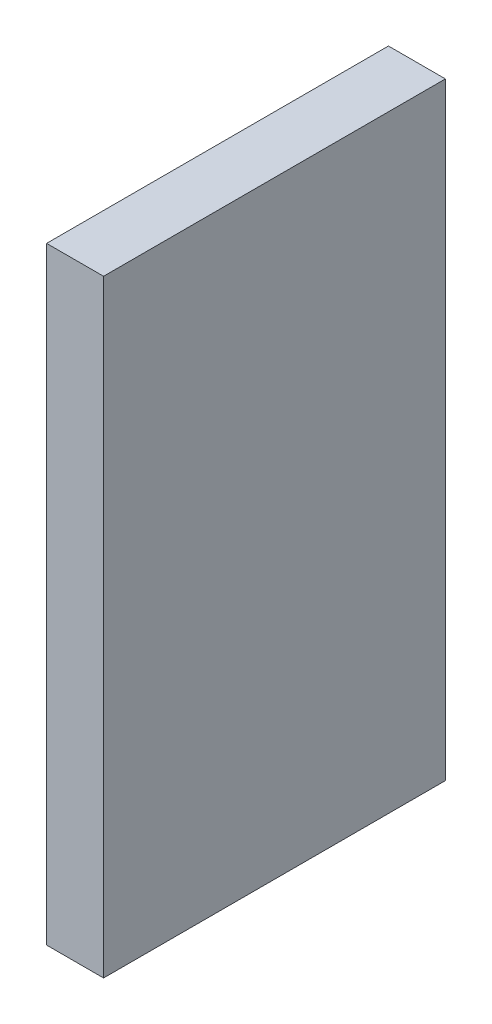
ISO-10303-21;
HEADER;
FILE_DESCRIPTION(('STEP AP214'),'2;1');
FILE_NAME('part.step','',(''),(''),'','','');
FILE_SCHEMA(('AUTOMOTIVE_DESIGN { 1 0 10303 214 1 1 1 1 }'));
ENDSEC;
DATA;
#1=APPLICATION_CONTEXT('core data for automotive mechanical design processes');
#2=APPLICATION_PROTOCOL_DEFINITION('international standard','automotive_design',2000,#1);
#3=PRODUCT_CONTEXT('',#1,'mechanical');
#4=PRODUCT('Part','Part','',(#3));
#5=PRODUCT_RELATED_PRODUCT_CATEGORY('part','',(#4));
#6=PRODUCT_DEFINITION_FORMATION('','',#4);
#7=PRODUCT_DEFINITION_CONTEXT('part definition',#1,'design');
#8=PRODUCT_DEFINITION('design','',#6,#7);
#9=PRODUCT_DEFINITION_SHAPE('','',#8);
#10=(LENGTH_UNIT() NAMED_UNIT(*) SI_UNIT(.MILLI.,.METRE.));
#11=(NAMED_UNIT(*) PLANE_ANGLE_UNIT() SI_UNIT($,.RADIAN.));
#12=(NAMED_UNIT(*) SI_UNIT($,.STERADIAN.) SOLID_ANGLE_UNIT());
#13=UNCERTAINTY_MEASURE_WITH_UNIT(LENGTH_MEASURE(1.E-05),#10,'distance_accuracy_value','');
#14=(GEOMETRIC_REPRESENTATION_CONTEXT(3) GLOBAL_UNCERTAINTY_ASSIGNED_CONTEXT((#13)) GLOBAL_UNIT_ASSIGNED_CONTEXT((#10,
#11,#12)) REPRESENTATION_CONTEXT('',''));
#15=CARTESIAN_POINT('',(0.,0.,0.));
#16=DIRECTION('',(0.,0.,1.));
#17=DIRECTION('',(1.,0.,0.));
#18=AXIS2_PLACEMENT_3D('',#15,#16,#17);
#19=CARTESIAN_POINT('',(5.,0.,21.5));
#20=DIRECTION('',(-1.,0.,0.));
#21=DIRECTION('',(0.,0.,1.));
#22=AXIS2_PLACEMENT_3D('',#19,#20,#21);
#23=PLANE('',#22);
#24=DIRECTION('',(0.,0.,1.));
#25=VECTOR('',#24,1.);
#26=CARTESIAN_POINT('',(5.,8.,26.));
#27=LINE('',#26,#25);
#28=CARTESIAN_POINT('',(5.,8.,17.));
#29=VERTEX_POINT('',#28);
#30=CARTESIAN_POINT('',(5.,8.,26.));
#31=VERTEX_POINT('',#30);
#32=EDGE_CURVE('E74',#29,#31,#27,.T.);
#33=ORIENTED_EDGE('',*,*,#32,.F.);
#34=DIRECTION('',(0.,1.,0.));
#35=VECTOR('',#34,1.);
#36=CARTESIAN_POINT('',(5.,-8.,17.));
#37=LINE('',#36,#35);
#38=CARTESIAN_POINT('',(5.,-8.,17.));
#39=VERTEX_POINT('',#38);
#40=EDGE_CURVE('E66',#29,#39,#37,.F.);
#41=ORIENTED_EDGE('',*,*,#40,.T.);
#42=DIRECTION('',(0.,0.,-1.));
#43=VECTOR('',#42,1.);
#44=CARTESIAN_POINT('',(5.,-8.,17.));
#45=LINE('',#44,#43);
#46=CARTESIAN_POINT('',(5.,-8.,26.));
#47=VERTEX_POINT('',#46);
#48=EDGE_CURVE('E20',#47,#39,#45,.T.);
#49=ORIENTED_EDGE('',*,*,#48,.F.);
#50=DIRECTION('',(0.,1.,0.));
#51=VECTOR('',#50,1.);
#52=CARTESIAN_POINT('',(5.,8.,26.));
#53=LINE('',#52,#51);
#54=EDGE_CURVE('E55',#47,#31,#53,.T.);
#55=ORIENTED_EDGE('',*,*,#54,.T.);
#56=EDGE_LOOP('',(#33,#41,#49,#55));
#57=FACE_BOUND('',#56,.T.);
#58=ADVANCED_FACE('F17',(#57),#23,.T.);
#59=CARTESIAN_POINT('',(6.5,-8.,17.));
#60=DIRECTION('',(0.,-1.,0.));
#61=DIRECTION('',(0.,0.,-1.));
#62=AXIS2_PLACEMENT_3D('',#59,#60,#61);
#63=PLANE('',#62);
#64=DIRECTION('',(-1.,0.,0.));
#65=VECTOR('',#64,1.);
#66=CARTESIAN_POINT('',(6.5,-8.,26.));
#67=LINE('',#66,#65);
#68=CARTESIAN_POINT('',(6.5,-8.,26.));
#69=VERTEX_POINT('',#68);
#70=EDGE_CURVE('E62',#69,#47,#67,.T.);
#71=ORIENTED_EDGE('',*,*,#70,.T.);
#72=ORIENTED_EDGE('',*,*,#48,.T.);
#73=DIRECTION('',(1.,0.,0.));
#74=VECTOR('',#73,1.);
#75=CARTESIAN_POINT('',(6.5,-8.,17.));
#76=LINE('',#75,#74);
#77=CARTESIAN_POINT('',(6.5,-8.,17.));
#78=VERTEX_POINT('',#77);
#79=EDGE_CURVE('E79',#39,#78,#76,.T.);
#80=ORIENTED_EDGE('',*,*,#79,.T.);
#81=DIRECTION('',(0.,0.,1.));
#82=VECTOR('',#81,1.);
#83=CARTESIAN_POINT('',(6.5,-8.,21.5));
#84=LINE('',#83,#82);
#85=EDGE_CURVE('E72',#78,#69,#84,.T.);
#86=ORIENTED_EDGE('',*,*,#85,.T.);
#87=EDGE_LOOP('',(#71,#72,#80,#86));
#88=FACE_BOUND('',#87,.T.);
#89=ADVANCED_FACE('F71',(#88),#63,.T.);
#90=CARTESIAN_POINT('',(6.5,8.,26.));
#91=DIRECTION('',(0.,0.,-1.));
#92=DIRECTION('',(-1.,0.,0.));
#93=AXIS2_PLACEMENT_3D('',#90,#91,#92);
#94=PLANE('',#93);
#95=DIRECTION('',(0.,1.,0.));
#96=VECTOR('',#95,1.);
#97=CARTESIAN_POINT('',(6.5,0.,26.));
#98=LINE('',#97,#96);
#99=CARTESIAN_POINT('',(6.5,8.,26.));
#100=VERTEX_POINT('',#99);
#101=EDGE_CURVE('E83',#69,#100,#98,.T.);
#102=ORIENTED_EDGE('',*,*,#101,.T.);
#103=DIRECTION('',(1.,0.,0.));
#104=VECTOR('',#103,1.);
#105=CARTESIAN_POINT('',(6.5,8.,26.));
#106=LINE('',#105,#104);
#107=EDGE_CURVE('E64',#31,#100,#106,.T.);
#108=ORIENTED_EDGE('',*,*,#107,.F.);
#109=ORIENTED_EDGE('',*,*,#54,.F.);
#110=ORIENTED_EDGE('',*,*,#70,.F.);
#111=EDGE_LOOP('',(#102,#108,#109,#110));
#112=FACE_BOUND('',#111,.T.);
#113=ADVANCED_FACE('F60',(#112),#94,.F.);
#114=CARTESIAN_POINT('',(6.5,8.,26.));
#115=DIRECTION('',(0.,1.,0.));
#116=DIRECTION('',(0.,0.,1.));
#117=AXIS2_PLACEMENT_3D('',#114,#115,#116);
#118=PLANE('',#117);
#119=DIRECTION('',(1.,0.,0.));
#120=VECTOR('',#119,1.);
#121=CARTESIAN_POINT('',(6.5,8.,17.));
#122=LINE('',#121,#120);
#123=CARTESIAN_POINT('',(6.5,8.,17.));
#124=VERTEX_POINT('',#123);
#125=EDGE_CURVE('E34',#124,#29,#122,.F.);
#126=ORIENTED_EDGE('',*,*,#125,.T.);
#127=ORIENTED_EDGE('',*,*,#32,.T.);
#128=ORIENTED_EDGE('',*,*,#107,.T.);
#129=DIRECTION('',(0.,0.,1.));
#130=VECTOR('',#129,1.);
#131=CARTESIAN_POINT('',(6.5,8.,21.5));
#132=LINE('',#131,#130);
#133=EDGE_CURVE('E26',#100,#124,#132,.F.);
#134=ORIENTED_EDGE('',*,*,#133,.T.);
#135=EDGE_LOOP('',(#126,#127,#128,#134));
#136=FACE_BOUND('',#135,.T.);
#137=ADVANCED_FACE('F88',(#136),#118,.T.);
#138=CARTESIAN_POINT('',(6.5,-8.,17.));
#139=DIRECTION('',(0.,0.,1.));
#140=DIRECTION('',(1.,0.,0.));
#141=AXIS2_PLACEMENT_3D('',#138,#139,#140);
#142=PLANE('',#141);
#143=DIRECTION('',(0.,1.,0.));
#144=VECTOR('',#143,1.);
#145=CARTESIAN_POINT('',(6.5,0.,17.));
#146=LINE('',#145,#144);
#147=EDGE_CURVE('E11',#124,#78,#146,.F.);
#148=ORIENTED_EDGE('',*,*,#147,.T.);
#149=ORIENTED_EDGE('',*,*,#79,.F.);
#150=ORIENTED_EDGE('',*,*,#40,.F.);
#151=ORIENTED_EDGE('',*,*,#125,.F.);
#152=EDGE_LOOP('',(#148,#149,#150,#151));
#153=FACE_BOUND('',#152,.T.);
#154=ADVANCED_FACE('F91',(#153),#142,.F.);
#155=CARTESIAN_POINT('',(6.5,0.,21.5));
#156=DIRECTION('',(-1.,0.,0.));
#157=DIRECTION('',(0.,0.,1.));
#158=AXIS2_PLACEMENT_3D('',#155,#156,#157);
#159=PLANE('',#158);
#160=ORIENTED_EDGE('',*,*,#133,.F.);
#161=ORIENTED_EDGE('',*,*,#101,.F.);
#162=ORIENTED_EDGE('',*,*,#85,.F.);
#163=ORIENTED_EDGE('',*,*,#147,.F.);
#164=EDGE_LOOP('',(#160,#161,#162,#163));
#165=FACE_BOUND('',#164,.T.);
#166=ADVANCED_FACE('F90',(#165),#159,.F.);
#167=CLOSED_SHELL('',(#58,#89,#113,#137,#154,#166));
#168=MANIFOLD_SOLID_BREP('B1',#167);
#169=ADVANCED_BREP_SHAPE_REPRESENTATION('',(#18,#168),#14);
#170=SHAPE_DEFINITION_REPRESENTATION(#9,#169);
ENDSEC;
END-ISO-10303-21;
